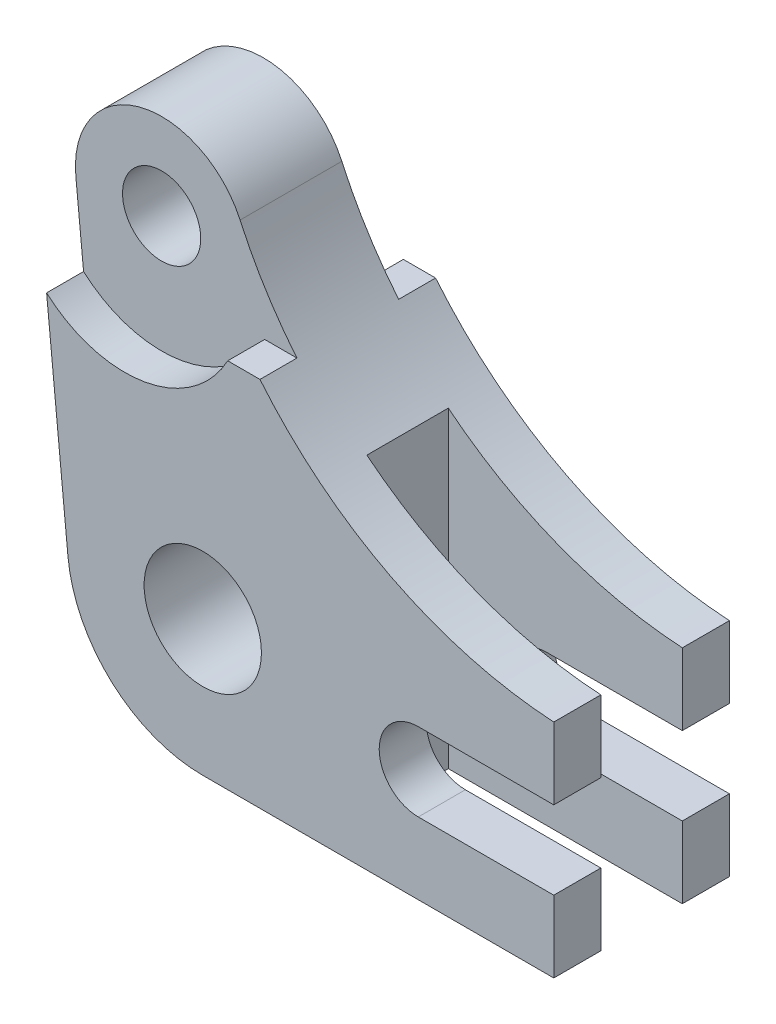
ISO-10303-21;
HEADER;
FILE_DESCRIPTION(('STEP AP214'),'2;1');
FILE_NAME('part.step','',(''),(''),'','','');
FILE_SCHEMA(('AUTOMOTIVE_DESIGN { 1 0 10303 214 1 1 1 1 }'));
ENDSEC;
DATA;
#1=APPLICATION_CONTEXT('core data for automotive mechanical design processes');
#2=APPLICATION_PROTOCOL_DEFINITION('international standard','automotive_design',2000,#1);
#3=PRODUCT_CONTEXT('',#1,'mechanical');
#4=PRODUCT('Part','Part','',(#3));
#5=PRODUCT_RELATED_PRODUCT_CATEGORY('part','',(#4));
#6=PRODUCT_DEFINITION_FORMATION('','',#4);
#7=PRODUCT_DEFINITION_CONTEXT('part definition',#1,'design');
#8=PRODUCT_DEFINITION('design','',#6,#7);
#9=PRODUCT_DEFINITION_SHAPE('','',#8);
#10=(LENGTH_UNIT() NAMED_UNIT(*) SI_UNIT(.MILLI.,.METRE.));
#11=(NAMED_UNIT(*) PLANE_ANGLE_UNIT() SI_UNIT($,.RADIAN.));
#12=(NAMED_UNIT(*) SI_UNIT($,.STERADIAN.) SOLID_ANGLE_UNIT());
#13=UNCERTAINTY_MEASURE_WITH_UNIT(LENGTH_MEASURE(1.E-05),#10,'distance_accuracy_value','');
#14=(GEOMETRIC_REPRESENTATION_CONTEXT(3) GLOBAL_UNCERTAINTY_ASSIGNED_CONTEXT((#13)) GLOBAL_UNIT_ASSIGNED_CONTEXT((#10,
#11,#12)) REPRESENTATION_CONTEXT('',''));
#15=CARTESIAN_POINT('',(0.,0.,0.));
#16=DIRECTION('',(0.,0.,1.));
#17=DIRECTION('',(1.,0.,0.));
#18=AXIS2_PLACEMENT_3D('',#15,#16,#17);
#19=CARTESIAN_POINT('',(73.726300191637,33.5474687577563,14.26));
#20=DIRECTION('',(0.,0.,-1.));
#21=DIRECTION('',(-1.,0.,0.));
#22=AXIS2_PLACEMENT_3D('',#19,#20,#21);
#23=CYLINDRICAL_SURFACE('',#22,67.);
#24=CARTESIAN_POINT('',(73.726300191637,33.5474687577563,-6.615));
#25=DIRECTION('',(0.,0.,-1.));
#26=DIRECTION('',(1.,0.,0.));
#27=AXIS2_PLACEMENT_3D('',#24,#25,#26);
#28=CIRCLE('',#27,67.);
#29=CARTESIAN_POINT('',(69.6821332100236,-33.3303654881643,-6.615));
#30=VERTEX_POINT('',#29);
#31=CARTESIAN_POINT('',(31.6821332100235,-18.6184973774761,-6.615));
#32=VERTEX_POINT('',#31);
#33=EDGE_CURVE('E210',#30,#32,#28,.T.);
#34=ORIENTED_EDGE('',*,*,#33,.F.);
#35=DIRECTION('',(0.,0.,-1.));
#36=VECTOR('',#35,1.);
#37=CARTESIAN_POINT('',(69.6821332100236,-33.3303654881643,14.26));
#38=LINE('',#37,#36);
#39=CARTESIAN_POINT('',(69.6821332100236,-33.3303654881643,-14.26));
#40=VERTEX_POINT('',#39);
#41=EDGE_CURVE('E347',#30,#40,#38,.T.);
#42=ORIENTED_EDGE('',*,*,#41,.T.);
#43=CARTESIAN_POINT('',(73.726300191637,33.5474687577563,-14.26));
#44=DIRECTION('',(0.,0.,-1.));
#45=DIRECTION('',(1.,0.,0.));
#46=AXIS2_PLACEMENT_3D('',#43,#44,#45);
#47=CIRCLE('',#46,67.);
#48=CARTESIAN_POINT('',(21.9700164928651,-8.99999999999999,-14.26));
#49=VERTEX_POINT('',#48);
#50=EDGE_CURVE('E314',#40,#49,#47,.T.);
#51=ORIENTED_EDGE('',*,*,#50,.T.);
#52=DIRECTION('',(0.,0.,-1.));
#53=VECTOR('',#52,1.);
#54=CARTESIAN_POINT('',(21.9700164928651,-8.99999999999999,-8.26));
#55=LINE('',#54,#53);
#56=CARTESIAN_POINT('',(21.9700164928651,-8.99999999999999,-8.26));
#57=VERTEX_POINT('',#56);
#58=EDGE_CURVE('E266',#57,#49,#55,.T.);
#59=ORIENTED_EDGE('',*,*,#58,.F.);
#60=CARTESIAN_POINT('',(73.726300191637,33.5474687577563,-8.26));
#61=DIRECTION('',(0.,0.,-1.));
#62=DIRECTION('',(1.,0.,0.));
#63=AXIS2_PLACEMENT_3D('',#60,#61,#62);
#64=CIRCLE('',#63,67.);
#65=CARTESIAN_POINT('',(12.7428173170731,5.79832793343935,-8.26));
#66=VERTEX_POINT('',#65);
#67=EDGE_CURVE('E249',#57,#66,#64,.T.);
#68=ORIENTED_EDGE('',*,*,#67,.T.);
#69=DIRECTION('',(0.,0.,-1.));
#70=VECTOR('',#69,1.);
#71=CARTESIAN_POINT('',(12.7428173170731,5.79832793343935,14.26));
#72=LINE('',#71,#70);
#73=CARTESIAN_POINT('',(12.7428173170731,5.79832793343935,8.26));
#74=VERTEX_POINT('',#73);
#75=EDGE_CURVE('E11',#74,#66,#72,.T.);
#76=ORIENTED_EDGE('',*,*,#75,.F.);
#77=CARTESIAN_POINT('',(73.726300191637,33.5474687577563,8.26));
#78=DIRECTION('',(0.,0.,-1.));
#79=DIRECTION('',(1.,0.,0.));
#80=AXIS2_PLACEMENT_3D('',#77,#78,#79);
#81=CIRCLE('',#80,67.);
#82=CARTESIAN_POINT('',(21.9700164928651,-8.99999999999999,8.26));
#83=VERTEX_POINT('',#82);
#84=EDGE_CURVE('E284',#83,#74,#81,.T.);
#85=ORIENTED_EDGE('',*,*,#84,.F.);
#86=DIRECTION('',(0.,0.,1.));
#87=VECTOR('',#86,1.);
#88=CARTESIAN_POINT('',(21.9700164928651,-8.99999999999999,8.26));
#89=LINE('',#88,#87);
#90=CARTESIAN_POINT('',(21.9700164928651,-8.99999999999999,14.26));
#91=VERTEX_POINT('',#90);
#92=EDGE_CURVE('E304',#83,#91,#89,.T.);
#93=ORIENTED_EDGE('',*,*,#92,.T.);
#94=CARTESIAN_POINT('',(73.726300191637,33.5474687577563,14.26));
#95=DIRECTION('',(0.,0.,-1.));
#96=DIRECTION('',(1.,0.,0.));
#97=AXIS2_PLACEMENT_3D('',#94,#95,#96);
#98=CIRCLE('',#97,67.);
#99=CARTESIAN_POINT('',(69.6821332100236,-33.3303654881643,14.26));
#100=VERTEX_POINT('',#99);
#101=EDGE_CURVE('E318',#100,#91,#98,.T.);
#102=ORIENTED_EDGE('',*,*,#101,.F.);
#103=CARTESIAN_POINT('',(69.6821332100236,-33.3303654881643,6.615));
#104=VERTEX_POINT('',#103);
#105=EDGE_CURVE('E380',#100,#104,#38,.T.);
#106=ORIENTED_EDGE('',*,*,#105,.T.);
#107=CARTESIAN_POINT('',(73.726300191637,33.5474687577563,6.615));
#108=DIRECTION('',(0.,0.,-1.));
#109=DIRECTION('',(1.,0.,0.));
#110=AXIS2_PLACEMENT_3D('',#107,#108,#109);
#111=CIRCLE('',#110,67.);
#112=CARTESIAN_POINT('',(31.6821332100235,-18.6184973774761,6.615));
#113=VERTEX_POINT('',#112);
#114=EDGE_CURVE('E51',#104,#113,#111,.T.);
#115=ORIENTED_EDGE('',*,*,#114,.T.);
#116=DIRECTION('',(0.,0.,1.));
#117=VECTOR('',#116,1.);
#118=CARTESIAN_POINT('',(31.6821332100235,-18.6184973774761,-6.615));
#119=LINE('',#118,#117);
#120=EDGE_CURVE('E203',#32,#113,#119,.T.);
#121=ORIENTED_EDGE('',*,*,#120,.F.);
#122=EDGE_LOOP('',(#34,#42,#51,#59,#68,#76,#85,#93,#102,#106,#115,#121));
#123=FACE_BOUND('',#122,.T.);
#124=ADVANCED_FACE('F36',(#123),#23,.F.);
#125=CARTESIAN_POINT('',(12.6821332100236,-69.3303654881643,14.26));
#126=DIRECTION('',(0.,1.,0.));
#127=DIRECTION('',(0.,0.,1.));
#128=AXIS2_PLACEMENT_3D('',#125,#126,#127);
#129=PLANE('',#128);
#130=DIRECTION('',(1.,0.,0.));
#131=VECTOR('',#130,1.);
#132=CARTESIAN_POINT('',(31.6821332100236,-69.3303654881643,-6.615));
#133=LINE('',#132,#131);
#134=CARTESIAN_POINT('',(31.6821332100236,-69.3303654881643,-6.615));
#135=VERTEX_POINT('',#134);
#136=CARTESIAN_POINT('',(69.6821332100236,-69.3303654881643,-6.615));
#137=VERTEX_POINT('',#136);
#138=EDGE_CURVE('E209',#135,#137,#133,.T.);
#139=ORIENTED_EDGE('',*,*,#138,.F.);
#140=DIRECTION('',(0.,0.,1.));
#141=VECTOR('',#140,1.);
#142=CARTESIAN_POINT('',(31.6821332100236,-69.3303654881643,-6.615));
#143=LINE('',#142,#141);
#144=CARTESIAN_POINT('',(31.6821332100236,-69.3303654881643,6.615));
#145=VERTEX_POINT('',#144);
#146=EDGE_CURVE('E205',#135,#145,#143,.T.);
#147=ORIENTED_EDGE('',*,*,#146,.T.);
#148=DIRECTION('',(1.,0.,0.));
#149=VECTOR('',#148,1.);
#150=CARTESIAN_POINT('',(31.6821332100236,-69.3303654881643,6.615));
#151=LINE('',#150,#149);
#152=CARTESIAN_POINT('',(69.6821332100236,-69.3303654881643,6.615));
#153=VERTEX_POINT('',#152);
#154=EDGE_CURVE('E489',#145,#153,#151,.T.);
#155=ORIENTED_EDGE('',*,*,#154,.T.);
#156=DIRECTION('',(0.,0.,-1.));
#157=VECTOR('',#156,1.);
#158=CARTESIAN_POINT('',(69.6821332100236,-69.3303654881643,14.26));
#159=LINE('',#158,#157);
#160=CARTESIAN_POINT('',(69.6821332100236,-69.3303654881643,14.26));
#161=VERTEX_POINT('',#160);
#162=EDGE_CURVE('E404',#161,#153,#159,.T.);
#163=ORIENTED_EDGE('',*,*,#162,.F.);
#164=DIRECTION('',(1.,0.,0.));
#165=VECTOR('',#164,1.);
#166=CARTESIAN_POINT('',(12.6821332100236,-69.3303654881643,14.26));
#167=LINE('',#166,#165);
#168=CARTESIAN_POINT('',(12.6821332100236,-69.3303654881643,14.26));
#169=VERTEX_POINT('',#168);
#170=EDGE_CURVE('E329',#169,#161,#167,.T.);
#171=ORIENTED_EDGE('',*,*,#170,.F.);
#172=DIRECTION('',(0.,0.,-1.));
#173=VECTOR('',#172,1.);
#174=CARTESIAN_POINT('',(12.6821332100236,-69.3303654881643,14.26));
#175=LINE('',#174,#173);
#176=CARTESIAN_POINT('',(12.6821332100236,-69.3303654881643,-14.26));
#177=VERTEX_POINT('',#176);
#178=EDGE_CURVE('E408',#169,#177,#175,.T.);
#179=ORIENTED_EDGE('',*,*,#178,.T.);
#180=DIRECTION('',(1.,0.,0.));
#181=VECTOR('',#180,1.);
#182=CARTESIAN_POINT('',(12.6821332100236,-69.3303654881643,-14.26));
#183=LINE('',#182,#181);
#184=CARTESIAN_POINT('',(69.6821332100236,-69.3303654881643,-14.26));
#185=VERTEX_POINT('',#184);
#186=EDGE_CURVE('E357',#177,#185,#183,.T.);
#187=ORIENTED_EDGE('',*,*,#186,.T.);
#188=EDGE_CURVE('E403',#137,#185,#159,.T.);
#189=ORIENTED_EDGE('',*,*,#188,.F.);
#190=EDGE_LOOP('',(#139,#147,#155,#163,#171,#179,#187,#189));
#191=FACE_BOUND('',#190,.T.);
#192=ADVANCED_FACE('F518',(#191),#129,.F.);
#193=CARTESIAN_POINT('',(69.6821332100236,-57.6803654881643,14.26));
#194=DIRECTION('',(-1.,0.,0.));
#195=DIRECTION('',(0.,0.,1.));
#196=AXIS2_PLACEMENT_3D('',#193,#194,#195);
#197=PLANE('',#196);
#198=DIRECTION('',(0.,1.,0.));
#199=VECTOR('',#198,1.);
#200=CARTESIAN_POINT('',(69.6821332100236,-69.3303654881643,-6.615));
#201=LINE('',#200,#199);
#202=CARTESIAN_POINT('',(69.6821332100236,-57.6803654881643,-6.615));
#203=VERTEX_POINT('',#202);
#204=EDGE_CURVE('E506',#137,#203,#201,.T.);
#205=ORIENTED_EDGE('',*,*,#204,.F.);
#206=ORIENTED_EDGE('',*,*,#188,.T.);
#207=DIRECTION('',(0.,1.,0.));
#208=VECTOR('',#207,1.);
#209=CARTESIAN_POINT('',(69.6821332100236,-57.6803654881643,-14.26));
#210=LINE('',#209,#208);
#211=CARTESIAN_POINT('',(69.6821332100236,-57.6803654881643,-14.26));
#212=VERTEX_POINT('',#211);
#213=EDGE_CURVE('E361',#185,#212,#210,.T.);
#214=ORIENTED_EDGE('',*,*,#213,.T.);
#215=DIRECTION('',(0.,0.,-1.));
#216=VECTOR('',#215,1.);
#217=CARTESIAN_POINT('',(69.6821332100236,-57.6803654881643,14.26));
#218=LINE('',#217,#216);
#219=EDGE_CURVE('E398',#203,#212,#218,.T.);
#220=ORIENTED_EDGE('',*,*,#219,.F.);
#221=EDGE_LOOP('',(#205,#206,#214,#220));
#222=FACE_BOUND('',#221,.T.);
#223=ADVANCED_FACE('F517',(#222),#197,.F.);
#224=CARTESIAN_POINT('',(47.6821332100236,-57.6803654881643,14.26));
#225=DIRECTION('',(0.,-1.,0.));
#226=DIRECTION('',(1.,0.,0.));
#227=AXIS2_PLACEMENT_3D('',#224,#225,#226);
#228=PLANE('',#227);
#229=DIRECTION('',(-1.,0.,0.));
#230=VECTOR('',#229,1.);
#231=CARTESIAN_POINT('',(69.6821332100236,-57.6803654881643,-6.615));
#232=LINE('',#231,#230);
#233=CARTESIAN_POINT('',(47.6821332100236,-57.6803654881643,-6.615));
#234=VERTEX_POINT('',#233);
#235=EDGE_CURVE('E503',#203,#234,#232,.T.);
#236=ORIENTED_EDGE('',*,*,#235,.F.);
#237=ORIENTED_EDGE('',*,*,#219,.T.);
#238=DIRECTION('',(-1.,0.,0.));
#239=VECTOR('',#238,1.);
#240=CARTESIAN_POINT('',(47.6821332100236,-57.6803654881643,-14.26));
#241=LINE('',#240,#239);
#242=CARTESIAN_POINT('',(47.6821332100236,-57.6803654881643,-14.26));
#243=VERTEX_POINT('',#242);
#244=EDGE_CURVE('E365',#212,#243,#241,.T.);
#245=ORIENTED_EDGE('',*,*,#244,.T.);
#246=DIRECTION('',(0.,0.,-1.));
#247=VECTOR('',#246,1.);
#248=CARTESIAN_POINT('',(47.6821332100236,-57.6803654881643,14.26));
#249=LINE('',#248,#247);
#250=EDGE_CURVE('E393',#234,#243,#249,.T.);
#251=ORIENTED_EDGE('',*,*,#250,.F.);
#252=EDGE_LOOP('',(#236,#237,#245,#251));
#253=FACE_BOUND('',#252,.T.);
#254=ADVANCED_FACE('F596',(#253),#228,.F.);
#255=CARTESIAN_POINT('',(47.6821332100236,-51.3303654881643,14.26));
#256=DIRECTION('',(0.,0.,-1.));
#257=DIRECTION('',(-1.,0.,0.));
#258=AXIS2_PLACEMENT_3D('',#255,#256,#257);
#259=CYLINDRICAL_SURFACE('',#258,6.35);
#260=CARTESIAN_POINT('',(47.6821332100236,-51.3303654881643,-6.615));
#261=DIRECTION('',(0.,0.,-1.));
#262=DIRECTION('',(1.,0.,0.));
#263=AXIS2_PLACEMENT_3D('',#260,#261,#262);
#264=CIRCLE('',#263,6.35);
#265=CARTESIAN_POINT('',(47.6821332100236,-44.9803654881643,-6.615));
#266=VERTEX_POINT('',#265);
#267=EDGE_CURVE('E500',#234,#266,#264,.T.);
#268=ORIENTED_EDGE('',*,*,#267,.F.);
#269=ORIENTED_EDGE('',*,*,#250,.T.);
#270=CARTESIAN_POINT('',(47.6821332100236,-51.3303654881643,-14.26));
#271=DIRECTION('',(0.,0.,-1.));
#272=DIRECTION('',(1.,0.,0.));
#273=AXIS2_PLACEMENT_3D('',#270,#271,#272);
#274=CIRCLE('',#273,6.35);
#275=CARTESIAN_POINT('',(47.6821332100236,-44.9803654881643,-14.26));
#276=VERTEX_POINT('',#275);
#277=EDGE_CURVE('E369',#243,#276,#274,.T.);
#278=ORIENTED_EDGE('',*,*,#277,.T.);
#279=DIRECTION('',(0.,0.,-1.));
#280=VECTOR('',#279,1.);
#281=CARTESIAN_POINT('',(47.6821332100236,-44.9803654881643,14.26));
#282=LINE('',#281,#280);
#283=EDGE_CURVE('E388',#266,#276,#282,.T.);
#284=ORIENTED_EDGE('',*,*,#283,.F.);
#285=EDGE_LOOP('',(#268,#269,#278,#284));
#286=FACE_BOUND('',#285,.T.);
#287=ADVANCED_FACE('F593',(#286),#259,.F.);
#288=CARTESIAN_POINT('',(47.6821332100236,-44.9803654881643,14.26));
#289=DIRECTION('',(0.,1.,0.));
#290=DIRECTION('',(-1.,0.,0.));
#291=AXIS2_PLACEMENT_3D('',#288,#289,#290);
#292=PLANE('',#291);
#293=DIRECTION('',(1.,0.,0.));
#294=VECTOR('',#293,1.);
#295=CARTESIAN_POINT('',(47.6821332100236,-44.9803654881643,-6.615));
#296=LINE('',#295,#294);
#297=CARTESIAN_POINT('',(69.6821332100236,-44.9803654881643,-6.615));
#298=VERTEX_POINT('',#297);
#299=EDGE_CURVE('E229',#266,#298,#296,.T.);
#300=ORIENTED_EDGE('',*,*,#299,.F.);
#301=ORIENTED_EDGE('',*,*,#283,.T.);
#302=DIRECTION('',(1.,0.,0.));
#303=VECTOR('',#302,1.);
#304=CARTESIAN_POINT('',(47.6821332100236,-44.9803654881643,-14.26));
#305=LINE('',#304,#303);
#306=CARTESIAN_POINT('',(69.6821332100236,-44.9803654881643,-14.26));
#307=VERTEX_POINT('',#306);
#308=EDGE_CURVE('E373',#276,#307,#305,.T.);
#309=ORIENTED_EDGE('',*,*,#308,.T.);
#310=DIRECTION('',(0.,0.,-1.));
#311=VECTOR('',#310,1.);
#312=CARTESIAN_POINT('',(69.6821332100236,-44.9803654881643,14.26));
#313=LINE('',#312,#311);
#314=EDGE_CURVE('E383',#298,#307,#313,.T.);
#315=ORIENTED_EDGE('',*,*,#314,.F.);
#316=EDGE_LOOP('',(#300,#301,#309,#315));
#317=FACE_BOUND('',#316,.T.);
#318=ADVANCED_FACE('F589',(#317),#292,.F.);
#319=CARTESIAN_POINT('',(69.6821332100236,-44.9803654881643,14.26));
#320=DIRECTION('',(-1.,0.,0.));
#321=DIRECTION('',(0.,0.,1.));
#322=AXIS2_PLACEMENT_3D('',#319,#320,#321);
#323=PLANE('',#322);
#324=DIRECTION('',(0.,1.,0.));
#325=VECTOR('',#324,1.);
#326=CARTESIAN_POINT('',(69.6821332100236,-44.9803654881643,-6.615));
#327=LINE('',#326,#325);
#328=EDGE_CURVE('E215',#298,#30,#327,.T.);
#329=ORIENTED_EDGE('',*,*,#328,.F.);
#330=ORIENTED_EDGE('',*,*,#314,.T.);
#331=DIRECTION('',(0.,1.,0.));
#332=VECTOR('',#331,1.);
#333=CARTESIAN_POINT('',(69.6821332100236,-44.9803654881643,-14.26));
#334=LINE('',#333,#332);
#335=EDGE_CURVE('E323',#307,#40,#334,.T.);
#336=ORIENTED_EDGE('',*,*,#335,.T.);
#337=ORIENTED_EDGE('',*,*,#41,.F.);
#338=EDGE_LOOP('',(#329,#330,#336,#337));
#339=FACE_BOUND('',#338,.T.);
#340=ADVANCED_FACE('F582',(#339),#323,.F.);
#341=CARTESIAN_POINT('',(0.,0.,14.26));
#342=DIRECTION('',(0.,0.,-1.));
#343=DIRECTION('',(-1.,0.,0.));
#344=AXIS2_PLACEMENT_3D('',#341,#342,#343);
#345=CYLINDRICAL_SURFACE('',#344,14.);
#346=CARTESIAN_POINT('',(0.,0.,-8.26));
#347=DIRECTION('',(0.,0.,1.));
#348=DIRECTION('',(1.,0.,0.));
#349=AXIS2_PLACEMENT_3D('',#346,#347,#348);
#350=CIRCLE('',#349,14.);
#351=CARTESIAN_POINT('',(-13.9330995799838,-1.36701722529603,-8.26));
#352=VERTEX_POINT('',#351);
#353=EDGE_CURVE('E245',#66,#352,#350,.T.);
#354=ORIENTED_EDGE('',*,*,#353,.T.);
#355=DIRECTION('',(0.,0.,-1.));
#356=VECTOR('',#355,1.);
#357=CARTESIAN_POINT('',(-13.9330995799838,-1.36701722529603,14.26));
#358=LINE('',#357,#356);
#359=CARTESIAN_POINT('',(-13.9330995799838,-1.36701722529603,8.26));
#360=VERTEX_POINT('',#359);
#361=EDGE_CURVE('E44',#360,#352,#358,.T.);
#362=ORIENTED_EDGE('',*,*,#361,.F.);
#363=CARTESIAN_POINT('',(0.,0.,8.26));
#364=DIRECTION('',(0.,0.,1.));
#365=DIRECTION('',(1.,0.,0.));
#366=AXIS2_PLACEMENT_3D('',#363,#364,#365);
#367=CIRCLE('',#366,14.);
#368=EDGE_CURVE('E287',#74,#360,#367,.T.);
#369=ORIENTED_EDGE('',*,*,#368,.F.);
#370=ORIENTED_EDGE('',*,*,#75,.T.);
#371=EDGE_LOOP('',(#354,#362,#369,#370));
#372=FACE_BOUND('',#371,.T.);
#373=ADVANCED_FACE('F425',(#372),#345,.T.);
#374=CARTESIAN_POINT('',(0.,0.,14.26));
#375=DIRECTION('',(0.,0.,-1.));
#376=DIRECTION('',(-1.,0.,0.));
#377=AXIS2_PLACEMENT_3D('',#374,#375,#376);
#378=CYLINDRICAL_SURFACE('',#377,6.35);
#379=CARTESIAN_POINT('',(0.,0.,8.26));
#380=DIRECTION('',(0.,0.,1.));
#381=DIRECTION('',(1.,0.,0.));
#382=AXIS2_PLACEMENT_3D('',#379,#380,#381);
#383=CIRCLE('',#382,6.35);
#384=CARTESIAN_POINT('',(6.35,0.,8.26));
#385=VERTEX_POINT('',#384);
#386=EDGE_CURVE('E265',#385,#385,#383,.T.);
#387=ORIENTED_EDGE('',*,*,#386,.T.);
#388=EDGE_LOOP('',(#387));
#389=FACE_BOUND('',#388,.T.);
#390=CARTESIAN_POINT('',(0.,0.,-8.26));
#391=DIRECTION('',(0.,0.,1.));
#392=DIRECTION('',(1.,0.,0.));
#393=AXIS2_PLACEMENT_3D('',#390,#391,#392);
#394=CIRCLE('',#393,6.35);
#395=CARTESIAN_POINT('',(6.35,0.,-8.26));
#396=VERTEX_POINT('',#395);
#397=EDGE_CURVE('E227',#396,#396,#394,.T.);
#398=ORIENTED_EDGE('',*,*,#397,.F.);
#399=EDGE_LOOP('',(#398));
#400=FACE_BOUND('',#399,.T.);
#401=ADVANCED_FACE('F622',(#389,#400),#378,.F.);
#402=CARTESIAN_POINT('',(73.726300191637,33.5474687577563,-14.26));
#403=DIRECTION('',(0.,0.,1.));
#404=DIRECTION('',(1.,0.,0.));
#405=AXIS2_PLACEMENT_3D('',#402,#403,#404);
#406=PLANE('',#405);
#407=CARTESIAN_POINT('',(12.6821332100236,-47.3303654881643,-14.26));
#408=DIRECTION('',(0.,0.,1.));
#409=DIRECTION('',(1.,0.,0.));
#410=AXIS2_PLACEMENT_3D('',#407,#408,#409);
#411=CIRCLE('',#410,9.525);
#412=CARTESIAN_POINT('',(22.2071332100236,-47.3303654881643,-14.26));
#413=VERTEX_POINT('',#412);
#414=EDGE_CURVE('E303',#413,#413,#411,.T.);
#415=ORIENTED_EDGE('',*,*,#414,.T.);
#416=EDGE_LOOP('',(#415));
#417=FACE_BOUND('',#416,.T.);
#418=CARTESIAN_POINT('',(0.,0.,-14.26));
#419=DIRECTION('',(0.,0.,1.));
#420=DIRECTION('',(1.,0.,0.));
#421=AXIS2_PLACEMENT_3D('',#418,#419,#420);
#422=CIRCLE('',#421,19.);
#423=CARTESIAN_POINT('',(-12.6788385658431,-14.1508675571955,-14.26));
#424=VERTEX_POINT('',#423);
#425=CARTESIAN_POINT('',(16.7332005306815,-9.,-14.26));
#426=VERTEX_POINT('',#425);
#427=EDGE_CURVE('E59',#424,#426,#422,.T.);
#428=ORIENTED_EDGE('',*,*,#427,.T.);
#429=DIRECTION('',(1.,0.,0.));
#430=VECTOR('',#429,1.);
#431=CARTESIAN_POINT('',(21.9700164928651,-9.,-14.26));
#432=LINE('',#431,#430);
#433=EDGE_CURVE('E241',#426,#49,#432,.T.);
#434=ORIENTED_EDGE('',*,*,#433,.T.);
#435=ORIENTED_EDGE('',*,*,#50,.F.);
#436=ORIENTED_EDGE('',*,*,#335,.F.);
#437=ORIENTED_EDGE('',*,*,#308,.F.);
#438=ORIENTED_EDGE('',*,*,#277,.F.);
#439=ORIENTED_EDGE('',*,*,#244,.F.);
#440=ORIENTED_EDGE('',*,*,#213,.F.);
#441=ORIENTED_EDGE('',*,*,#186,.F.);
#442=CARTESIAN_POINT('',(12.6821332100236,-47.3303654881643,-14.26));
#443=DIRECTION('',(0.,0.,1.));
#444=DIRECTION('',(-1.,0.,0.));
#445=AXIS2_PLACEMENT_3D('',#442,#443,#444);
#446=CIRCLE('',#445,22.);
#447=CARTESIAN_POINT('',(-9.21273755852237,-49.4785354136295,-14.26));
#448=VERTEX_POINT('',#447);
#449=EDGE_CURVE('E354',#448,#177,#446,.T.);
#450=ORIENTED_EDGE('',*,*,#449,.F.);
#451=DIRECTION('',(0.0976440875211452,-0.99522139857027,0.));
#452=VECTOR('',#451,1.);
#453=CARTESIAN_POINT('',(-9.21273755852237,-49.4785354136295,-14.26));
#454=LINE('',#453,#452);
#455=EDGE_CURVE('E351',#424,#448,#454,.T.);
#456=ORIENTED_EDGE('',*,*,#455,.F.);
#457=EDGE_LOOP('',(#428,#434,#435,#436,#437,#438,#439,#440,#441,#450,#456));
#458=FACE_BOUND('',#457,.T.);
#459=ADVANCED_FACE('F439',(#417,#458),#406,.F.);
#460=CARTESIAN_POINT('',(-9.21273755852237,-49.4785354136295,14.26));
#461=DIRECTION('',(0.995221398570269,0.0976440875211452,0.));
#462=DIRECTION('',(-0.0976440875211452,0.995221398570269,0.));
#463=AXIS2_PLACEMENT_3D('',#460,#461,#462);
#464=PLANE('',#463);
#465=DIRECTION('',(0.0976440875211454,-0.995221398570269,0.));
#466=VECTOR('',#465,1.);
#467=CARTESIAN_POINT('',(-12.6788385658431,-14.1508675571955,-8.26));
#468=LINE('',#467,#466);
#469=CARTESIAN_POINT('',(-12.6788385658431,-14.1508675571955,-8.26));
#470=VERTEX_POINT('',#469);
#471=EDGE_CURVE('E240',#352,#470,#468,.T.);
#472=ORIENTED_EDGE('',*,*,#471,.T.);
#473=DIRECTION('',(0.,0.,-1.));
#474=VECTOR('',#473,1.);
#475=CARTESIAN_POINT('',(-12.6788385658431,-14.1508675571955,-8.26));
#476=LINE('',#475,#474);
#477=EDGE_CURVE('E256',#470,#424,#476,.T.);
#478=ORIENTED_EDGE('',*,*,#477,.T.);
#479=ORIENTED_EDGE('',*,*,#455,.T.);
#480=DIRECTION('',(0.,0.,-1.));
#481=VECTOR('',#480,1.);
#482=CARTESIAN_POINT('',(-9.21273755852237,-49.4785354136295,14.26));
#483=LINE('',#482,#481);
#484=CARTESIAN_POINT('',(-9.21273755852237,-49.4785354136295,14.26));
#485=VERTEX_POINT('',#484);
#486=EDGE_CURVE('E412',#485,#448,#483,.T.);
#487=ORIENTED_EDGE('',*,*,#486,.F.);
#488=DIRECTION('',(0.0976440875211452,-0.99522139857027,0.));
#489=VECTOR('',#488,1.);
#490=CARTESIAN_POINT('',(-9.21273755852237,-49.4785354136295,14.26));
#491=LINE('',#490,#489);
#492=CARTESIAN_POINT('',(-12.6788385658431,-14.1508675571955,14.26));
#493=VERTEX_POINT('',#492);
#494=EDGE_CURVE('E322',#493,#485,#491,.T.);
#495=ORIENTED_EDGE('',*,*,#494,.F.);
#496=DIRECTION('',(0.,0.,1.));
#497=VECTOR('',#496,1.);
#498=CARTESIAN_POINT('',(-12.6788385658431,-14.1508675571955,8.26));
#499=LINE('',#498,#497);
#500=CARTESIAN_POINT('',(-12.6788385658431,-14.1508675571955,8.26));
#501=VERTEX_POINT('',#500);
#502=EDGE_CURVE('E300',#501,#493,#499,.T.);
#503=ORIENTED_EDGE('',*,*,#502,.F.);
#504=DIRECTION('',(0.0976440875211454,-0.995221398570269,0.));
#505=VECTOR('',#504,1.);
#506=CARTESIAN_POINT('',(-12.6788385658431,-14.1508675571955,8.26));
#507=LINE('',#506,#505);
#508=EDGE_CURVE('E290',#360,#501,#507,.T.);
#509=ORIENTED_EDGE('',*,*,#508,.F.);
#510=ORIENTED_EDGE('',*,*,#361,.T.);
#511=EDGE_LOOP('',(#472,#478,#479,#487,#495,#503,#509,#510));
#512=FACE_BOUND('',#511,.T.);
#513=ADVANCED_FACE('F421',(#512),#464,.F.);
#514=CARTESIAN_POINT('',(73.726300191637,33.5474687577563,14.26));
#515=DIRECTION('',(0.,0.,1.));
#516=DIRECTION('',(1.,0.,0.));
#517=AXIS2_PLACEMENT_3D('',#514,#515,#516);
#518=PLANE('',#517);
#519=CARTESIAN_POINT('',(0.,0.,14.26));
#520=DIRECTION('',(0.,0.,1.));
#521=DIRECTION('',(1.,0.,0.));
#522=AXIS2_PLACEMENT_3D('',#519,#520,#521);
#523=CIRCLE('',#522,19.);
#524=CARTESIAN_POINT('',(16.7332005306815,-9.,14.26));
#525=VERTEX_POINT('',#524);
#526=EDGE_CURVE('E274',#493,#525,#523,.T.);
#527=ORIENTED_EDGE('',*,*,#526,.F.);
#528=ORIENTED_EDGE('',*,*,#494,.T.);
#529=CARTESIAN_POINT('',(12.6821332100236,-47.3303654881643,14.26));
#530=DIRECTION('',(0.,0.,1.));
#531=DIRECTION('',(-1.,0.,0.));
#532=AXIS2_PLACEMENT_3D('',#529,#530,#531);
#533=CIRCLE('',#532,22.);
#534=EDGE_CURVE('E326',#485,#169,#533,.T.);
#535=ORIENTED_EDGE('',*,*,#534,.T.);
#536=ORIENTED_EDGE('',*,*,#170,.T.);
#537=DIRECTION('',(0.,1.,0.));
#538=VECTOR('',#537,1.);
#539=CARTESIAN_POINT('',(69.6821332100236,-57.6803654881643,14.26));
#540=LINE('',#539,#538);
#541=CARTESIAN_POINT('',(69.6821332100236,-57.6803654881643,14.26));
#542=VERTEX_POINT('',#541);
#543=EDGE_CURVE('E332',#161,#542,#540,.T.);
#544=ORIENTED_EDGE('',*,*,#543,.T.);
#545=DIRECTION('',(-1.,0.,0.));
#546=VECTOR('',#545,1.);
#547=CARTESIAN_POINT('',(47.6821332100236,-57.6803654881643,14.26));
#548=LINE('',#547,#546);
#549=CARTESIAN_POINT('',(47.6821332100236,-57.6803654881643,14.26));
#550=VERTEX_POINT('',#549);
#551=EDGE_CURVE('E335',#542,#550,#548,.T.);
#552=ORIENTED_EDGE('',*,*,#551,.T.);
#553=CARTESIAN_POINT('',(47.6821332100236,-51.3303654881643,14.26));
#554=DIRECTION('',(0.,0.,-1.));
#555=DIRECTION('',(1.,0.,0.));
#556=AXIS2_PLACEMENT_3D('',#553,#554,#555);
#557=CIRCLE('',#556,6.35);
#558=CARTESIAN_POINT('',(47.6821332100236,-44.9803654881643,14.26));
#559=VERTEX_POINT('',#558);
#560=EDGE_CURVE('E338',#550,#559,#557,.T.);
#561=ORIENTED_EDGE('',*,*,#560,.T.);
#562=DIRECTION('',(1.,0.,0.));
#563=VECTOR('',#562,1.);
#564=CARTESIAN_POINT('',(47.6821332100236,-44.9803654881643,14.26));
#565=LINE('',#564,#563);
#566=CARTESIAN_POINT('',(69.6821332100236,-44.9803654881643,14.26));
#567=VERTEX_POINT('',#566);
#568=EDGE_CURVE('E341',#559,#567,#565,.T.);
#569=ORIENTED_EDGE('',*,*,#568,.T.);
#570=DIRECTION('',(0.,1.,0.));
#571=VECTOR('',#570,1.);
#572=CARTESIAN_POINT('',(69.6821332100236,-44.9803654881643,14.26));
#573=LINE('',#572,#571);
#574=EDGE_CURVE('E344',#567,#100,#573,.T.);
#575=ORIENTED_EDGE('',*,*,#574,.T.);
#576=ORIENTED_EDGE('',*,*,#101,.T.);
#577=DIRECTION('',(1.,0.,0.));
#578=VECTOR('',#577,1.);
#579=CARTESIAN_POINT('',(21.9700164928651,-9.,14.26));
#580=LINE('',#579,#578);
#581=EDGE_CURVE('E280',#525,#91,#580,.T.);
#582=ORIENTED_EDGE('',*,*,#581,.F.);
#583=EDGE_LOOP('',(#527,#528,#535,#536,#544,#552,#561,#569,#575,#576,#582));
#584=FACE_BOUND('',#583,.T.);
#585=CARTESIAN_POINT('',(12.6821332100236,-47.3303654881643,14.26));
#586=DIRECTION('',(0.,0.,1.));
#587=DIRECTION('',(1.,0.,0.));
#588=AXIS2_PLACEMENT_3D('',#585,#586,#587);
#589=CIRCLE('',#588,9.525);
#590=CARTESIAN_POINT('',(22.2071332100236,-47.3303654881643,14.26));
#591=VERTEX_POINT('',#590);
#592=EDGE_CURVE('E310',#591,#591,#589,.T.);
#593=ORIENTED_EDGE('',*,*,#592,.F.);
#594=EDGE_LOOP('',(#593));
#595=FACE_BOUND('',#594,.T.);
#596=ADVANCED_FACE('F453',(#584,#595),#518,.T.);
#597=CARTESIAN_POINT('',(12.6821332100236,-47.3303654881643,14.26));
#598=DIRECTION('',(0.,0.,-1.));
#599=DIRECTION('',(-1.,0.,0.));
#600=AXIS2_PLACEMENT_3D('',#597,#598,#599);
#601=CYLINDRICAL_SURFACE('',#600,22.);
#602=ORIENTED_EDGE('',*,*,#449,.T.);
#603=ORIENTED_EDGE('',*,*,#178,.F.);
#604=ORIENTED_EDGE('',*,*,#534,.F.);
#605=ORIENTED_EDGE('',*,*,#486,.T.);
#606=EDGE_LOOP('',(#602,#603,#604,#605));
#607=FACE_BOUND('',#606,.T.);
#608=ADVANCED_FACE('F448',(#607),#601,.T.);
#609=ORIENTED_EDGE('',*,*,#162,.T.);
#610=DIRECTION('',(0.,1.,0.));
#611=VECTOR('',#610,1.);
#612=CARTESIAN_POINT('',(69.6821332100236,-69.3303654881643,6.615));
#613=LINE('',#612,#611);
#614=CARTESIAN_POINT('',(69.6821332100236,-57.6803654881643,6.615));
#615=VERTEX_POINT('',#614);
#616=EDGE_CURVE('E485',#153,#615,#613,.T.);
#617=ORIENTED_EDGE('',*,*,#616,.T.);
#618=EDGE_CURVE('E399',#542,#615,#218,.T.);
#619=ORIENTED_EDGE('',*,*,#618,.F.);
#620=ORIENTED_EDGE('',*,*,#543,.F.);
#621=EDGE_LOOP('',(#609,#617,#619,#620));
#622=FACE_BOUND('',#621,.T.);
#623=ADVANCED_FACE('F607',(#622),#197,.F.);
#624=ORIENTED_EDGE('',*,*,#618,.T.);
#625=DIRECTION('',(-1.,0.,0.));
#626=VECTOR('',#625,1.);
#627=CARTESIAN_POINT('',(69.6821332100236,-57.6803654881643,6.615));
#628=LINE('',#627,#626);
#629=CARTESIAN_POINT('',(47.6821332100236,-57.6803654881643,6.615));
#630=VERTEX_POINT('',#629);
#631=EDGE_CURVE('E481',#615,#630,#628,.T.);
#632=ORIENTED_EDGE('',*,*,#631,.T.);
#633=EDGE_CURVE('E394',#550,#630,#249,.T.);
#634=ORIENTED_EDGE('',*,*,#633,.F.);
#635=ORIENTED_EDGE('',*,*,#551,.F.);
#636=EDGE_LOOP('',(#624,#632,#634,#635));
#637=FACE_BOUND('',#636,.T.);
#638=ADVANCED_FACE('F599',(#637),#228,.F.);
#639=ORIENTED_EDGE('',*,*,#633,.T.);
#640=CARTESIAN_POINT('',(47.6821332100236,-51.3303654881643,6.615));
#641=DIRECTION('',(0.,0.,-1.));
#642=DIRECTION('',(1.,0.,0.));
#643=AXIS2_PLACEMENT_3D('',#640,#641,#642);
#644=CIRCLE('',#643,6.35);
#645=CARTESIAN_POINT('',(47.6821332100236,-44.9803654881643,6.615));
#646=VERTEX_POINT('',#645);
#647=EDGE_CURVE('E475',#630,#646,#644,.T.);
#648=ORIENTED_EDGE('',*,*,#647,.T.);
#649=EDGE_CURVE('E389',#559,#646,#282,.T.);
#650=ORIENTED_EDGE('',*,*,#649,.F.);
#651=ORIENTED_EDGE('',*,*,#560,.F.);
#652=EDGE_LOOP('',(#639,#648,#650,#651));
#653=FACE_BOUND('',#652,.T.);
#654=ADVANCED_FACE('F605',(#653),#259,.F.);
#655=ORIENTED_EDGE('',*,*,#649,.T.);
#656=DIRECTION('',(1.,0.,0.));
#657=VECTOR('',#656,1.);
#658=CARTESIAN_POINT('',(47.6821332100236,-44.9803654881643,6.615));
#659=LINE('',#658,#657);
#660=CARTESIAN_POINT('',(69.6821332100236,-44.9803654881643,6.615));
#661=VERTEX_POINT('',#660);
#662=EDGE_CURVE('E472',#646,#661,#659,.T.);
#663=ORIENTED_EDGE('',*,*,#662,.T.);
#664=EDGE_CURVE('E384',#567,#661,#313,.T.);
#665=ORIENTED_EDGE('',*,*,#664,.F.);
#666=ORIENTED_EDGE('',*,*,#568,.F.);
#667=EDGE_LOOP('',(#655,#663,#665,#666));
#668=FACE_BOUND('',#667,.T.);
#669=ADVANCED_FACE('F634',(#668),#292,.F.);
#670=ORIENTED_EDGE('',*,*,#664,.T.);
#671=DIRECTION('',(0.,1.,0.));
#672=VECTOR('',#671,1.);
#673=CARTESIAN_POINT('',(69.6821332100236,-44.9803654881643,6.615));
#674=LINE('',#673,#672);
#675=EDGE_CURVE('E219',#661,#104,#674,.T.);
#676=ORIENTED_EDGE('',*,*,#675,.T.);
#677=ORIENTED_EDGE('',*,*,#105,.F.);
#678=ORIENTED_EDGE('',*,*,#574,.F.);
#679=EDGE_LOOP('',(#670,#676,#677,#678));
#680=FACE_BOUND('',#679,.T.);
#681=ADVANCED_FACE('F469',(#680),#323,.F.);
#682=CARTESIAN_POINT('',(12.6821332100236,-47.3303654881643,14.26));
#683=DIRECTION('',(0.,0.,-1.));
#684=DIRECTION('',(-1.,0.,0.));
#685=AXIS2_PLACEMENT_3D('',#682,#683,#684);
#686=CYLINDRICAL_SURFACE('',#685,9.525);
#687=ORIENTED_EDGE('',*,*,#592,.T.);
#688=EDGE_LOOP('',(#687));
#689=FACE_BOUND('',#688,.T.);
#690=ORIENTED_EDGE('',*,*,#414,.F.);
#691=EDGE_LOOP('',(#690));
#692=FACE_BOUND('',#691,.T.);
#693=ADVANCED_FACE('F637',(#689,#692),#686,.F.);
#694=CARTESIAN_POINT('',(0.,0.,8.26));
#695=DIRECTION('',(0.,0.,1.));
#696=DIRECTION('',(1.,0.,0.));
#697=AXIS2_PLACEMENT_3D('',#694,#695,#696);
#698=CYLINDRICAL_SURFACE('',#697,19.);
#699=ORIENTED_EDGE('',*,*,#526,.T.);
#700=DIRECTION('',(0.,0.,1.));
#701=VECTOR('',#700,1.);
#702=CARTESIAN_POINT('',(16.7332005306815,-9.,8.26));
#703=LINE('',#702,#701);
#704=CARTESIAN_POINT('',(16.7332005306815,-9.,8.26));
#705=VERTEX_POINT('',#704);
#706=EDGE_CURVE('E294',#705,#525,#703,.T.);
#707=ORIENTED_EDGE('',*,*,#706,.F.);
#708=CARTESIAN_POINT('',(0.,0.,8.26));
#709=DIRECTION('',(0.,0.,1.));
#710=DIRECTION('',(1.,0.,0.));
#711=AXIS2_PLACEMENT_3D('',#708,#709,#710);
#712=CIRCLE('',#711,19.);
#713=EDGE_CURVE('E275',#501,#705,#712,.T.);
#714=ORIENTED_EDGE('',*,*,#713,.F.);
#715=ORIENTED_EDGE('',*,*,#502,.T.);
#716=EDGE_LOOP('',(#699,#707,#714,#715));
#717=FACE_BOUND('',#716,.T.);
#718=ADVANCED_FACE('F458',(#717),#698,.F.);
#719=CARTESIAN_POINT('',(21.9700164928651,-9.,8.26));
#720=DIRECTION('',(0.,-1.,0.));
#721=DIRECTION('',(0.,0.,-1.));
#722=AXIS2_PLACEMENT_3D('',#719,#720,#721);
#723=PLANE('',#722);
#724=ORIENTED_EDGE('',*,*,#581,.T.);
#725=ORIENTED_EDGE('',*,*,#92,.F.);
#726=DIRECTION('',(1.,0.,0.));
#727=VECTOR('',#726,1.);
#728=CARTESIAN_POINT('',(21.9700164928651,-9.,8.26));
#729=LINE('',#728,#727);
#730=EDGE_CURVE('E279',#705,#83,#729,.T.);
#731=ORIENTED_EDGE('',*,*,#730,.F.);
#732=ORIENTED_EDGE('',*,*,#706,.T.);
#733=EDGE_LOOP('',(#724,#725,#731,#732));
#734=FACE_BOUND('',#733,.T.);
#735=ADVANCED_FACE('F697',(#734),#723,.F.);
#736=CARTESIAN_POINT('',(0.,0.,8.26));
#737=DIRECTION('',(0.,0.,1.));
#738=DIRECTION('',(1.,0.,0.));
#739=AXIS2_PLACEMENT_3D('',#736,#737,#738);
#740=PLANE('',#739);
#741=ORIENTED_EDGE('',*,*,#386,.F.);
#742=EDGE_LOOP('',(#741));
#743=FACE_BOUND('',#742,.T.);
#744=ORIENTED_EDGE('',*,*,#713,.T.);
#745=ORIENTED_EDGE('',*,*,#730,.T.);
#746=ORIENTED_EDGE('',*,*,#84,.T.);
#747=ORIENTED_EDGE('',*,*,#368,.T.);
#748=ORIENTED_EDGE('',*,*,#508,.T.);
#749=EDGE_LOOP('',(#744,#745,#746,#747,#748));
#750=FACE_BOUND('',#749,.T.);
#751=ADVANCED_FACE('F461',(#743,#750),#740,.T.);
#752=CARTESIAN_POINT('',(0.,0.,-8.26));
#753=DIRECTION('',(0.,0.,-1.));
#754=DIRECTION('',(1.,0.,0.));
#755=AXIS2_PLACEMENT_3D('',#752,#753,#754);
#756=PLANE('',#755);
#757=CARTESIAN_POINT('',(0.,0.,-8.26));
#758=DIRECTION('',(0.,0.,1.));
#759=DIRECTION('',(1.,0.,0.));
#760=AXIS2_PLACEMENT_3D('',#757,#758,#759);
#761=CIRCLE('',#760,19.);
#762=CARTESIAN_POINT('',(16.7332005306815,-9.,-8.26));
#763=VERTEX_POINT('',#762);
#764=EDGE_CURVE('E236',#470,#763,#761,.T.);
#765=ORIENTED_EDGE('',*,*,#764,.F.);
#766=ORIENTED_EDGE('',*,*,#471,.F.);
#767=ORIENTED_EDGE('',*,*,#353,.F.);
#768=ORIENTED_EDGE('',*,*,#67,.F.);
#769=DIRECTION('',(1.,0.,0.));
#770=VECTOR('',#769,1.);
#771=CARTESIAN_POINT('',(21.9700164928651,-9.,-8.26));
#772=LINE('',#771,#770);
#773=EDGE_CURVE('E253',#763,#57,#772,.T.);
#774=ORIENTED_EDGE('',*,*,#773,.F.);
#775=EDGE_LOOP('',(#765,#766,#767,#768,#774));
#776=FACE_BOUND('',#775,.T.);
#777=ORIENTED_EDGE('',*,*,#397,.T.);
#778=EDGE_LOOP('',(#777));
#779=FACE_BOUND('',#778,.T.);
#780=ADVANCED_FACE('F430',(#776,#779),#756,.T.);
#781=CARTESIAN_POINT('',(0.,0.,-8.26));
#782=DIRECTION('',(0.,0.,-1.));
#783=DIRECTION('',(-1.,0.,0.));
#784=AXIS2_PLACEMENT_3D('',#781,#782,#783);
#785=CYLINDRICAL_SURFACE('',#784,19.);
#786=ORIENTED_EDGE('',*,*,#427,.F.);
#787=ORIENTED_EDGE('',*,*,#477,.F.);
#788=ORIENTED_EDGE('',*,*,#764,.T.);
#789=DIRECTION('',(0.,0.,-1.));
#790=VECTOR('',#789,1.);
#791=CARTESIAN_POINT('',(16.7332005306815,-9.,-8.26));
#792=LINE('',#791,#790);
#793=EDGE_CURVE('E262',#763,#426,#792,.T.);
#794=ORIENTED_EDGE('',*,*,#793,.T.);
#795=EDGE_LOOP('',(#786,#787,#788,#794));
#796=FACE_BOUND('',#795,.T.);
#797=ADVANCED_FACE('F724',(#796),#785,.F.);
#798=CARTESIAN_POINT('',(21.9700164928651,-9.,-8.26));
#799=DIRECTION('',(0.,1.,0.));
#800=DIRECTION('',(0.,0.,1.));
#801=AXIS2_PLACEMENT_3D('',#798,#799,#800);
#802=PLANE('',#801);
#803=ORIENTED_EDGE('',*,*,#433,.F.);
#804=ORIENTED_EDGE('',*,*,#793,.F.);
#805=ORIENTED_EDGE('',*,*,#773,.T.);
#806=ORIENTED_EDGE('',*,*,#58,.T.);
#807=EDGE_LOOP('',(#803,#804,#805,#806));
#808=FACE_BOUND('',#807,.T.);
#809=ADVANCED_FACE('F436',(#808),#802,.T.);
#810=CARTESIAN_POINT('',(31.6821332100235,-18.6184973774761,-6.615));
#811=DIRECTION('',(-1.,0.,0.));
#812=DIRECTION('',(0.,-1.,0.));
#813=AXIS2_PLACEMENT_3D('',#810,#811,#812);
#814=PLANE('',#813);
#815=DIRECTION('',(0.,-1.,0.));
#816=VECTOR('',#815,1.);
#817=CARTESIAN_POINT('',(31.6821332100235,-18.6184973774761,6.615));
#818=LINE('',#817,#816);
#819=EDGE_CURVE('E493',#113,#145,#818,.T.);
#820=ORIENTED_EDGE('',*,*,#819,.T.);
#821=ORIENTED_EDGE('',*,*,#146,.F.);
#822=DIRECTION('',(0.,-1.,0.));
#823=VECTOR('',#822,1.);
#824=CARTESIAN_POINT('',(31.6821332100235,-18.6184973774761,-6.615));
#825=LINE('',#824,#823);
#826=EDGE_CURVE('E198',#32,#135,#825,.T.);
#827=ORIENTED_EDGE('',*,*,#826,.F.);
#828=ORIENTED_EDGE('',*,*,#120,.T.);
#829=EDGE_LOOP('',(#820,#821,#827,#828));
#830=FACE_BOUND('',#829,.T.);
#831=ADVANCED_FACE('F201',(#830),#814,.F.);
#832=CARTESIAN_POINT('',(73.726300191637,33.5474687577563,-6.615));
#833=DIRECTION('',(0.,0.,1.));
#834=DIRECTION('',(1.,0.,0.));
#835=AXIS2_PLACEMENT_3D('',#832,#833,#834);
#836=PLANE('',#835);
#837=ORIENTED_EDGE('',*,*,#33,.T.);
#838=ORIENTED_EDGE('',*,*,#826,.T.);
#839=ORIENTED_EDGE('',*,*,#138,.T.);
#840=ORIENTED_EDGE('',*,*,#204,.T.);
#841=ORIENTED_EDGE('',*,*,#235,.T.);
#842=ORIENTED_EDGE('',*,*,#267,.T.);
#843=ORIENTED_EDGE('',*,*,#299,.T.);
#844=ORIENTED_EDGE('',*,*,#328,.T.);
#845=EDGE_LOOP('',(#837,#838,#839,#840,#841,#842,#843,#844));
#846=FACE_BOUND('',#845,.T.);
#847=ADVANCED_FACE('F213',(#846),#836,.T.);
#848=CARTESIAN_POINT('',(73.726300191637,33.5474687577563,6.615));
#849=DIRECTION('',(0.,0.,1.));
#850=DIRECTION('',(1.,0.,0.));
#851=AXIS2_PLACEMENT_3D('',#848,#849,#850);
#852=PLANE('',#851);
#853=ORIENTED_EDGE('',*,*,#114,.F.);
#854=ORIENTED_EDGE('',*,*,#675,.F.);
#855=ORIENTED_EDGE('',*,*,#662,.F.);
#856=ORIENTED_EDGE('',*,*,#647,.F.);
#857=ORIENTED_EDGE('',*,*,#631,.F.);
#858=ORIENTED_EDGE('',*,*,#616,.F.);
#859=ORIENTED_EDGE('',*,*,#154,.F.);
#860=ORIENTED_EDGE('',*,*,#819,.F.);
#861=EDGE_LOOP('',(#853,#854,#855,#856,#857,#858,#859,#860));
#862=FACE_BOUND('',#861,.T.);
#863=ADVANCED_FACE('F652',(#862),#852,.F.);
#864=CLOSED_SHELL('',(#124,#192,#223,#254,#287,#318,#340,#373,#401,#459,#513,#596,#608,#623,
#638,#654,#669,#681,#693,#718,#735,#751,#780,#797,#809,#831,#847,#863));
#865=MANIFOLD_SOLID_BREP('B2',#864);
#866=ADVANCED_BREP_SHAPE_REPRESENTATION('',(#18,#865),#14);
#867=SHAPE_DEFINITION_REPRESENTATION(#9,#866);
ENDSEC;
END-ISO-10303-21;
